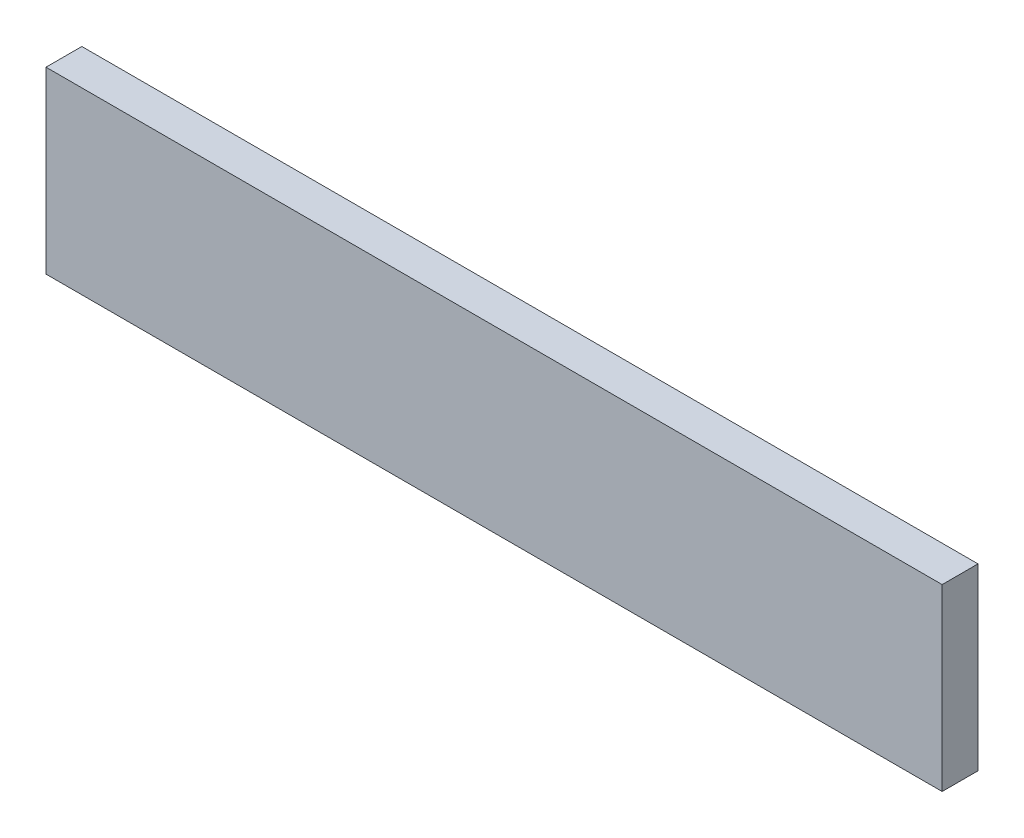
ISO-10303-21;
HEADER;
FILE_DESCRIPTION(('STEP AP214'),'2;1');
FILE_NAME('part.step','',(''),(''),'','','');
FILE_SCHEMA(('AUTOMOTIVE_DESIGN { 1 0 10303 214 1 1 1 1 }'));
ENDSEC;
DATA;
#1=APPLICATION_CONTEXT('core data for automotive mechanical design processes');
#2=APPLICATION_PROTOCOL_DEFINITION('international standard','automotive_design',2000,#1);
#3=PRODUCT_CONTEXT('',#1,'mechanical');
#4=PRODUCT('Part','Part','',(#3));
#5=PRODUCT_RELATED_PRODUCT_CATEGORY('part','',(#4));
#6=PRODUCT_DEFINITION_FORMATION('','',#4);
#7=PRODUCT_DEFINITION_CONTEXT('part definition',#1,'design');
#8=PRODUCT_DEFINITION('design','',#6,#7);
#9=PRODUCT_DEFINITION_SHAPE('','',#8);
#10=(LENGTH_UNIT() NAMED_UNIT(*) SI_UNIT(.MILLI.,.METRE.));
#11=(NAMED_UNIT(*) PLANE_ANGLE_UNIT() SI_UNIT($,.RADIAN.));
#12=(NAMED_UNIT(*) SI_UNIT($,.STERADIAN.) SOLID_ANGLE_UNIT());
#13=UNCERTAINTY_MEASURE_WITH_UNIT(LENGTH_MEASURE(1.E-05),#10,'distance_accuracy_value','');
#14=(GEOMETRIC_REPRESENTATION_CONTEXT(3) GLOBAL_UNCERTAINTY_ASSIGNED_CONTEXT((#13)) GLOBAL_UNIT_ASSIGNED_CONTEXT((#10,
#11,#12)) REPRESENTATION_CONTEXT('',''));
#15=CARTESIAN_POINT('',(0.,0.,0.));
#16=DIRECTION('',(0.,0.,1.));
#17=DIRECTION('',(1.,0.,0.));
#18=AXIS2_PLACEMENT_3D('',#15,#16,#17);
#19=CARTESIAN_POINT('',(0.,0.,10.));
#20=DIRECTION('',(1.,0.,0.));
#21=DIRECTION('',(0.,0.,-1.));
#22=AXIS2_PLACEMENT_3D('',#19,#20,#21);
#23=PLANE('',#22);
#24=DIRECTION('',(0.,-1.,0.));
#25=VECTOR('',#24,1.);
#26=CARTESIAN_POINT('',(0.,0.,0.));
#27=LINE('',#26,#25);
#28=CARTESIAN_POINT('',(0.,50.,0.));
#29=VERTEX_POINT('',#28);
#30=CARTESIAN_POINT('',(0.,0.,0.));
#31=VERTEX_POINT('',#30);
#32=EDGE_CURVE('E96',#29,#31,#27,.T.);
#33=ORIENTED_EDGE('',*,*,#32,.T.);
#34=DIRECTION('',(0.,0.,-1.));
#35=VECTOR('',#34,1.);
#36=CARTESIAN_POINT('',(0.,0.,10.));
#37=LINE('',#36,#35);
#38=CARTESIAN_POINT('',(0.,0.,10.));
#39=VERTEX_POINT('',#38);
#40=EDGE_CURVE('E11',#39,#31,#37,.T.);
#41=ORIENTED_EDGE('',*,*,#40,.F.);
#42=DIRECTION('',(0.,-1.,0.));
#43=VECTOR('',#42,1.);
#44=CARTESIAN_POINT('',(0.,0.,10.));
#45=LINE('',#44,#43);
#46=CARTESIAN_POINT('',(0.,50.,10.));
#47=VERTEX_POINT('',#46);
#48=EDGE_CURVE('E84',#47,#39,#45,.T.);
#49=ORIENTED_EDGE('',*,*,#48,.F.);
#50=DIRECTION('',(0.,0.,-1.));
#51=VECTOR('',#50,1.);
#52=CARTESIAN_POINT('',(0.,50.,10.));
#53=LINE('',#52,#51);
#54=EDGE_CURVE('E92',#47,#29,#53,.T.);
#55=ORIENTED_EDGE('',*,*,#54,.T.);
#56=EDGE_LOOP('',(#33,#41,#49,#55));
#57=FACE_BOUND('',#56,.T.);
#58=ADVANCED_FACE('F33',(#57),#23,.F.);
#59=CARTESIAN_POINT('',(0.,0.,10.));
#60=DIRECTION('',(0.,1.,0.));
#61=DIRECTION('',(0.,0.,1.));
#62=AXIS2_PLACEMENT_3D('',#59,#60,#61);
#63=PLANE('',#62);
#64=DIRECTION('',(1.,0.,0.));
#65=VECTOR('',#64,1.);
#66=CARTESIAN_POINT('',(0.,0.,0.));
#67=LINE('',#66,#65);
#68=CARTESIAN_POINT('',(250.,0.,0.));
#69=VERTEX_POINT('',#68);
#70=EDGE_CURVE('E88',#31,#69,#67,.T.);
#71=ORIENTED_EDGE('',*,*,#70,.T.);
#72=DIRECTION('',(0.,0.,-1.));
#73=VECTOR('',#72,1.);
#74=CARTESIAN_POINT('',(250.,0.,10.));
#75=LINE('',#74,#73);
#76=CARTESIAN_POINT('',(250.,0.,10.));
#77=VERTEX_POINT('',#76);
#78=EDGE_CURVE('E41',#77,#69,#75,.T.);
#79=ORIENTED_EDGE('',*,*,#78,.F.);
#80=DIRECTION('',(1.,0.,0.));
#81=VECTOR('',#80,1.);
#82=CARTESIAN_POINT('',(0.,0.,10.));
#83=LINE('',#82,#81);
#84=EDGE_CURVE('E79',#39,#77,#83,.T.);
#85=ORIENTED_EDGE('',*,*,#84,.F.);
#86=ORIENTED_EDGE('',*,*,#40,.T.);
#87=EDGE_LOOP('',(#71,#79,#85,#86));
#88=FACE_BOUND('',#87,.T.);
#89=ADVANCED_FACE('F87',(#88),#63,.F.);
#90=CARTESIAN_POINT('',(250.,0.,10.));
#91=DIRECTION('',(-1.,0.,0.));
#92=DIRECTION('',(0.,0.,1.));
#93=AXIS2_PLACEMENT_3D('',#90,#91,#92);
#94=PLANE('',#93);
#95=DIRECTION('',(0.,1.,0.));
#96=VECTOR('',#95,1.);
#97=CARTESIAN_POINT('',(250.,0.,0.));
#98=LINE('',#97,#96);
#99=CARTESIAN_POINT('',(250.,50.,0.));
#100=VERTEX_POINT('',#99);
#101=EDGE_CURVE('E66',#69,#100,#98,.T.);
#102=ORIENTED_EDGE('',*,*,#101,.T.);
#103=DIRECTION('',(0.,0.,-1.));
#104=VECTOR('',#103,1.);
#105=CARTESIAN_POINT('',(250.,50.,10.));
#106=LINE('',#105,#104);
#107=CARTESIAN_POINT('',(250.,50.,10.));
#108=VERTEX_POINT('',#107);
#109=EDGE_CURVE('E89',#108,#100,#106,.T.);
#110=ORIENTED_EDGE('',*,*,#109,.F.);
#111=DIRECTION('',(0.,1.,0.));
#112=VECTOR('',#111,1.);
#113=CARTESIAN_POINT('',(250.,0.,10.));
#114=LINE('',#113,#112);
#115=EDGE_CURVE('E82',#77,#108,#114,.T.);
#116=ORIENTED_EDGE('',*,*,#115,.F.);
#117=ORIENTED_EDGE('',*,*,#78,.T.);
#118=EDGE_LOOP('',(#102,#110,#116,#117));
#119=FACE_BOUND('',#118,.T.);
#120=ADVANCED_FACE('F90',(#119),#94,.F.);
#121=CARTESIAN_POINT('',(0.,50.,10.));
#122=DIRECTION('',(0.,-1.,0.));
#123=DIRECTION('',(0.,0.,-1.));
#124=AXIS2_PLACEMENT_3D('',#121,#122,#123);
#125=PLANE('',#124);
#126=DIRECTION('',(-1.,0.,0.));
#127=VECTOR('',#126,1.);
#128=CARTESIAN_POINT('',(0.,50.,0.));
#129=LINE('',#128,#127);
#130=EDGE_CURVE('E72',#100,#29,#129,.T.);
#131=ORIENTED_EDGE('',*,*,#130,.T.);
#132=ORIENTED_EDGE('',*,*,#54,.F.);
#133=DIRECTION('',(-1.,0.,0.));
#134=VECTOR('',#133,1.);
#135=CARTESIAN_POINT('',(0.,50.,10.));
#136=LINE('',#135,#134);
#137=EDGE_CURVE('E49',#108,#47,#136,.T.);
#138=ORIENTED_EDGE('',*,*,#137,.F.);
#139=ORIENTED_EDGE('',*,*,#109,.T.);
#140=EDGE_LOOP('',(#131,#132,#138,#139));
#141=FACE_BOUND('',#140,.T.);
#142=ADVANCED_FACE('F103',(#141),#125,.F.);
#143=CARTESIAN_POINT('',(0.,0.,10.));
#144=DIRECTION('',(0.,0.,-1.));
#145=DIRECTION('',(-1.,0.,0.));
#146=AXIS2_PLACEMENT_3D('',#143,#144,#145);
#147=PLANE('',#146);
#148=ORIENTED_EDGE('',*,*,#48,.T.);
#149=ORIENTED_EDGE('',*,*,#84,.T.);
#150=ORIENTED_EDGE('',*,*,#115,.T.);
#151=ORIENTED_EDGE('',*,*,#137,.T.);
#152=EDGE_LOOP('',(#148,#149,#150,#151));
#153=FACE_BOUND('',#152,.T.);
#154=ADVANCED_FACE('F80',(#153),#147,.F.);
#155=CARTESIAN_POINT('',(0.,0.,0.));
#156=DIRECTION('',(0.,0.,-1.));
#157=DIRECTION('',(-1.,0.,0.));
#158=AXIS2_PLACEMENT_3D('',#155,#156,#157);
#159=PLANE('',#158);
#160=ORIENTED_EDGE('',*,*,#32,.F.);
#161=ORIENTED_EDGE('',*,*,#130,.F.);
#162=ORIENTED_EDGE('',*,*,#101,.F.);
#163=ORIENTED_EDGE('',*,*,#70,.F.);
#164=EDGE_LOOP('',(#160,#161,#162,#163));
#165=FACE_BOUND('',#164,.T.);
#166=ADVANCED_FACE('F106',(#165),#159,.T.);
#167=CLOSED_SHELL('',(#58,#89,#120,#142,#154,#166));
#168=MANIFOLD_SOLID_BREP('B2',#167);
#169=ADVANCED_BREP_SHAPE_REPRESENTATION('',(#18,#168),#14);
#170=SHAPE_DEFINITION_REPRESENTATION(#9,#169);
ENDSEC;
END-ISO-10303-21;
